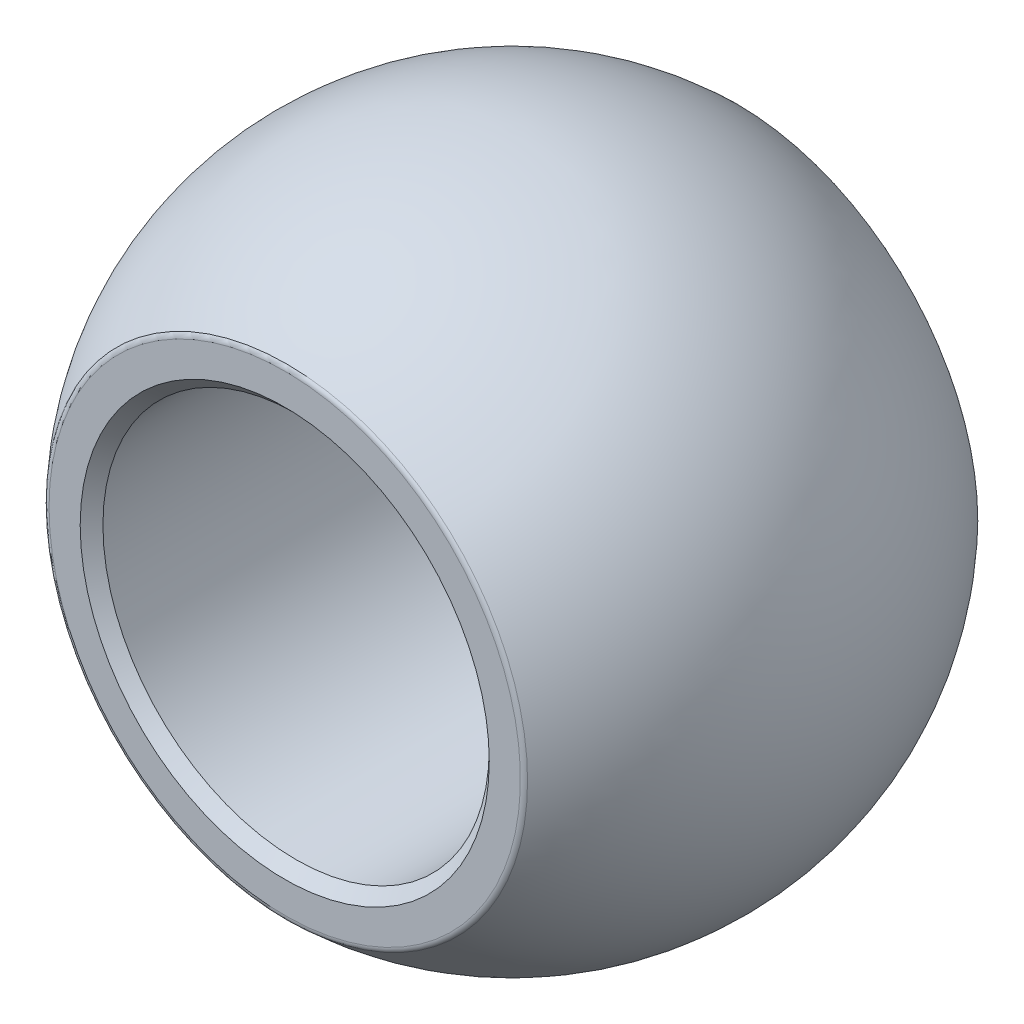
from build123d import *

# Parameters (mm, degrees)
CHANFREIN1_SIZE = 0.5
CONG_1_R        = 0.3


with BuildPart() as part:
    # Esquisse1 → Base-R_volution (revolve)
    with BuildSketch(Plane(origin=(0, 0, 0), x_dir=(0, 0, -1), z_dir=(1, 0, 0)), mode=Mode.PRIVATE) as base_r_volution_sk:
        with BuildLine():
            Line((10, 8.5), (-10, 8.5))
            Line((-10, 8.5), (-10, 10.5))
            ThreePointArc((-10, 10.5), (0, 14.5), (10, 10.5))
            Line((10, 10.5), (10, 8.5))
        make_face()
    revolve(base_r_volution_sk.sketch.rotate(Axis((0, 0, 24.320242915), (0, 0, -1)), 90), axis=Axis((0, 0, 24.320242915), (0, 0, -1)))

    # Chanfrein1
    chanfrein1_edges = [part.edges().sort_by_distance(p)[0] for p in [
        (-8.5, 0, -10),
        (-8.5, 0, 10),
    ]]
    chamfer(chanfrein1_edges, length=CHANFREIN1_SIZE)

    # Cong_1
    cong_1_edges = [part.edges().sort_by_distance(p)[0] for p in [
        (-10.5, 0, -10),
        (-10.5, 0, 10),
    ]]
    fillet(cong_1_edges, radius=CONG_1_R)


solid = part.part
